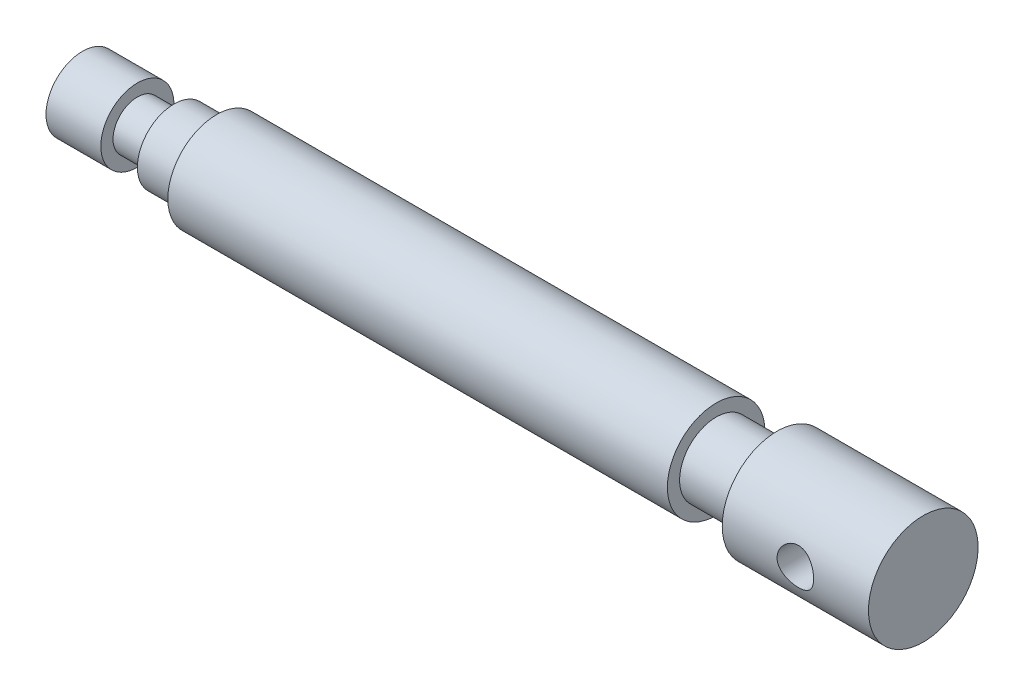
from build123d import *

# Parameters (mm, degrees)
SKETCH2_R          = 3
CUT_EXTRUDE1_DEPTH = 15


with BuildPart() as part:
    # Sketch1 → Revolve1 (revolve)
    with BuildSketch(Plane.XY, mode=Mode.PRIVATE) as revolve1_sk:
        Polygon((0, 0), (0, 6), (9, 6), (9, 4), (15, 4), (15, 6), (22, 6), (22, 8), (104, 8), (104, 6), (114, 6), (114, 9), (138, 9), (138, 0), align=None)
    revolve(revolve1_sk.sketch.rotate(Axis((-25.19031226, 0, 0), (1, 0, 0)), 90), axis=Axis((-25.19031226, 0, 0), (1, 0, 0)))

    # Sketch2 → Cut-Extrude1 (cut, symmetric)
    with BuildSketch(Plane.XY):
        with Locations((126, 0)):
            Circle(SKETCH2_R)
    extrude(amount=CUT_EXTRUDE1_DEPTH, both=True, mode=Mode.SUBTRACT)


solid = part.part
